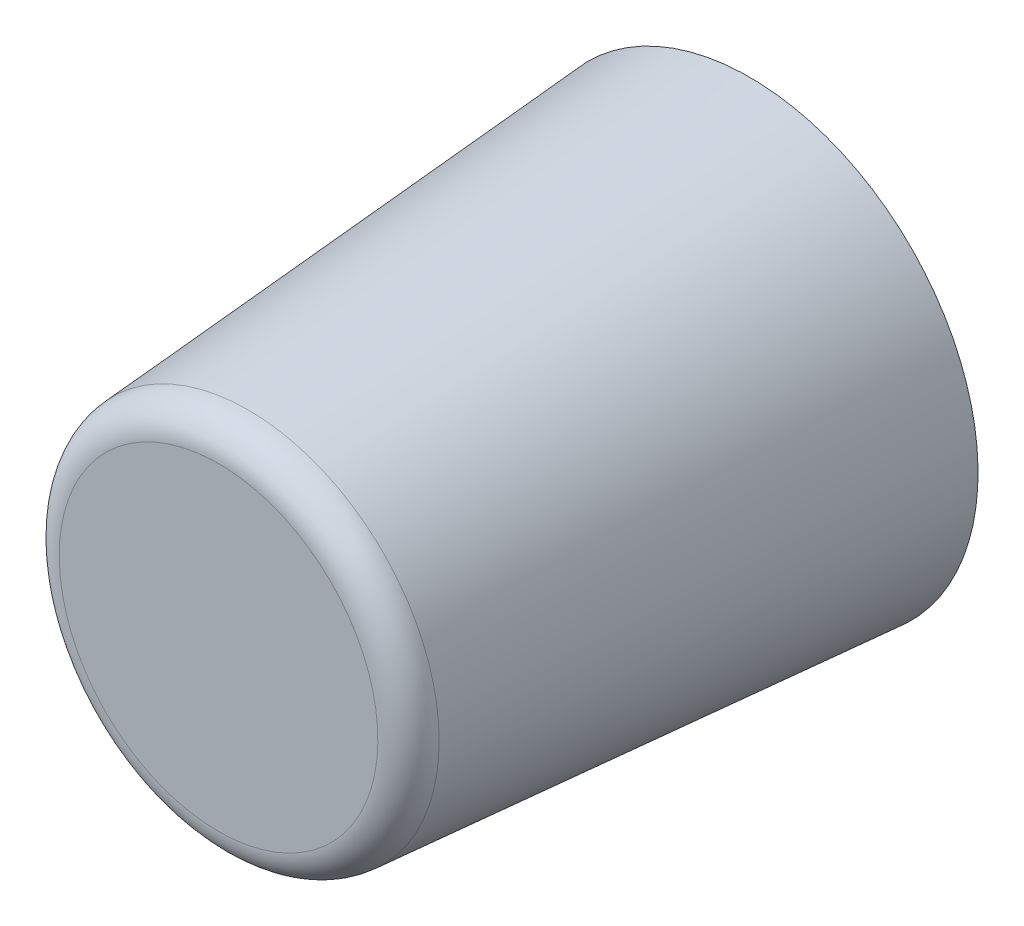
ISO-10303-21;
HEADER;
FILE_DESCRIPTION(('STEP AP214'),'2;1');
FILE_NAME('part.step','',(''),(''),'','','');
FILE_SCHEMA(('AUTOMOTIVE_DESIGN { 1 0 10303 214 1 1 1 1 }'));
ENDSEC;
DATA;
#1=APPLICATION_CONTEXT('core data for automotive mechanical design processes');
#2=APPLICATION_PROTOCOL_DEFINITION('international standard','automotive_design',2000,#1);
#3=PRODUCT_CONTEXT('',#1,'mechanical');
#4=PRODUCT('Part','Part','',(#3));
#5=PRODUCT_RELATED_PRODUCT_CATEGORY('part','',(#4));
#6=PRODUCT_DEFINITION_FORMATION('','',#4);
#7=PRODUCT_DEFINITION_CONTEXT('part definition',#1,'design');
#8=PRODUCT_DEFINITION('design','',#6,#7);
#9=PRODUCT_DEFINITION_SHAPE('','',#8);
#10=(LENGTH_UNIT() NAMED_UNIT(*) SI_UNIT(.MILLI.,.METRE.));
#11=(NAMED_UNIT(*) PLANE_ANGLE_UNIT() SI_UNIT($,.RADIAN.));
#12=(NAMED_UNIT(*) SI_UNIT($,.STERADIAN.) SOLID_ANGLE_UNIT());
#13=UNCERTAINTY_MEASURE_WITH_UNIT(LENGTH_MEASURE(1.E-05),#10,'distance_accuracy_value','');
#14=(GEOMETRIC_REPRESENTATION_CONTEXT(3) GLOBAL_UNCERTAINTY_ASSIGNED_CONTEXT((#13)) GLOBAL_UNIT_ASSIGNED_CONTEXT((#10,
#11,#12)) REPRESENTATION_CONTEXT('',''));
#15=CARTESIAN_POINT('',(0.,0.,0.));
#16=DIRECTION('',(0.,0.,1.));
#17=DIRECTION('',(1.,0.,0.));
#18=AXIS2_PLACEMENT_3D('',#15,#16,#17);
#19=CARTESIAN_POINT('',(0.,0.,50.));
#20=DIRECTION('',(0.,0.,1.));
#21=DIRECTION('',(0.,-1.,0.));
#22=AXIS2_PLACEMENT_3D('',#19,#20,#21);
#23=CYLINDRICAL_SURFACE('',#22,19.35);
#24=CARTESIAN_POINT('',(0.,0.,0.));
#25=DIRECTION('',(0.,0.,1.));
#26=DIRECTION('',(0.,-1.,0.));
#27=AXIS2_PLACEMENT_3D('',#24,#25,#26);
#28=CIRCLE('',#27,19.35);
#29=CARTESIAN_POINT('',(0.,-19.35,0.));
#30=VERTEX_POINT('',#29);
#31=EDGE_CURVE('E8',#30,#30,#28,.T.);
#32=ORIENTED_EDGE('',*,*,#31,.F.);
#33=EDGE_LOOP('',(#32));
#34=FACE_BOUND('',#33,.T.);
#35=CARTESIAN_POINT('',(0.,0.,0.0500000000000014));
#36=DIRECTION('',(0.,0.,1.));
#37=DIRECTION('',(0.,-1.,0.));
#38=AXIS2_PLACEMENT_3D('',#35,#36,#37);
#39=CIRCLE('',#38,19.35);
#40=CARTESIAN_POINT('',(0.,-19.35,0.0500000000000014));
#41=VERTEX_POINT('',#40);
#42=EDGE_CURVE('E34',#41,#41,#39,.T.);
#43=ORIENTED_EDGE('',*,*,#42,.T.);
#44=EDGE_LOOP('',(#43));
#45=FACE_BOUND('',#44,.T.);
#46=ADVANCED_FACE('F12',(#34,#45),#23,.F.);
#47=CARTESIAN_POINT('',(19.35,0.,0.));
#48=DIRECTION('',(0.,0.,1.));
#49=DIRECTION('',(0.,-1.,0.));
#50=AXIS2_PLACEMENT_3D('',#47,#48,#49);
#51=PLANE('',#50);
#52=CARTESIAN_POINT('',(0.,0.,0.));
#53=DIRECTION('',(0.,0.,1.));
#54=DIRECTION('',(0.,-1.,0.));
#55=AXIS2_PLACEMENT_3D('',#52,#53,#54);
#56=CIRCLE('',#55,21.5);
#57=CARTESIAN_POINT('',(0.,-21.5,0.));
#58=VERTEX_POINT('',#57);
#59=EDGE_CURVE('E18',#58,#58,#56,.T.);
#60=ORIENTED_EDGE('',*,*,#59,.F.);
#61=EDGE_LOOP('',(#60));
#62=FACE_BOUND('',#61,.T.);
#63=ORIENTED_EDGE('',*,*,#31,.T.);
#64=EDGE_LOOP('',(#63));
#65=FACE_BOUND('',#64,.T.);
#66=ADVANCED_FACE('F70',(#62,#65),#51,.F.);
#67=CARTESIAN_POINT('',(0.,0.,0.));
#68=DIRECTION('',(0.,0.,-1.));
#69=DIRECTION('',(0.,1.,0.));
#70=AXIS2_PLACEMENT_3D('',#67,#68,#69);
#71=CONICAL_SURFACE('',#70,21.5,0.0741559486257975);
#72=CARTESIAN_POINT('',(0.,0.,47.2222640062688));
#73=DIRECTION('',(0.,0.,1.));
#74=DIRECTION('',(0.,-1.,0.));
#75=AXIS2_PLACEMENT_3D('',#72,#73,#74);
#76=CIRCLE('',#75,17.9917551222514);
#77=CARTESIAN_POINT('',(0.,-17.9917551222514,47.2222640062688));
#78=VERTEX_POINT('',#77);
#79=EDGE_CURVE('E22',#78,#78,#76,.T.);
#80=ORIENTED_EDGE('',*,*,#79,.F.);
#81=EDGE_LOOP('',(#80));
#82=FACE_BOUND('',#81,.T.);
#83=ORIENTED_EDGE('',*,*,#59,.T.);
#84=EDGE_LOOP('',(#83));
#85=FACE_BOUND('',#84,.T.);
#86=ADVANCED_FACE('F75',(#82,#85),#71,.T.);
#87=CARTESIAN_POINT('',(0.,0.,47.));
#88=DIRECTION('',(0.,0.,1.));
#89=DIRECTION('',(0.,-1.,0.));
#90=AXIS2_PLACEMENT_3D('',#87,#88,#89);
#91=TOROIDAL_SURFACE('',#90,15.,3.);
#92=ORIENTED_EDGE('',*,*,#79,.T.);
#93=EDGE_LOOP('',(#92));
#94=FACE_BOUND('',#93,.T.);
#95=CARTESIAN_POINT('',(0.,0.,50.));
#96=DIRECTION('',(0.,0.,1.));
#97=DIRECTION('',(0.,-1.,0.));
#98=AXIS2_PLACEMENT_3D('',#95,#96,#97);
#99=CIRCLE('',#98,15.);
#100=CARTESIAN_POINT('',(0.,-15.,50.));
#101=VERTEX_POINT('',#100);
#102=EDGE_CURVE('E26',#101,#101,#99,.T.);
#103=ORIENTED_EDGE('',*,*,#102,.F.);
#104=EDGE_LOOP('',(#103));
#105=FACE_BOUND('',#104,.T.);
#106=ADVANCED_FACE('F65',(#94,#105),#91,.T.);
#107=CARTESIAN_POINT('',(15.,0.,50.));
#108=DIRECTION('',(0.,0.,-1.));
#109=DIRECTION('',(0.,1.,0.));
#110=AXIS2_PLACEMENT_3D('',#107,#108,#109);
#111=PLANE('',#110);
#112=ORIENTED_EDGE('',*,*,#102,.T.);
#113=EDGE_LOOP('',(#112));
#114=FACE_BOUND('',#113,.T.);
#115=ADVANCED_FACE('F55',(#114),#111,.F.);
#116=CARTESIAN_POINT('',(0.,0.,0.));
#117=DIRECTION('',(0.,0.,1.));
#118=DIRECTION('',(0.,-1.,0.));
#119=AXIS2_PLACEMENT_3D('',#116,#117,#118);
#120=PLANE('',#119);
#121=CARTESIAN_POINT('',(0.,0.,0.));
#122=DIRECTION('',(0.,0.,1.));
#123=DIRECTION('',(0.,-1.,0.));
#124=AXIS2_PLACEMENT_3D('',#121,#122,#123);
#125=CIRCLE('',#124,19.3);
#126=CARTESIAN_POINT('',(0.,-19.3,0.));
#127=VERTEX_POINT('',#126);
#128=EDGE_CURVE('E31',#127,#127,#125,.T.);
#129=ORIENTED_EDGE('',*,*,#128,.F.);
#130=EDGE_LOOP('',(#129));
#131=FACE_BOUND('',#130,.T.);
#132=CARTESIAN_POINT('',(0.,0.,0.));
#133=DIRECTION('',(0.,0.,-1.));
#134=DIRECTION('',(0.,1.,0.));
#135=AXIS2_PLACEMENT_3D('',#132,#133,#134);
#136=CIRCLE('',#135,5.);
#137=CARTESIAN_POINT('',(0.,5.,0.));
#138=VERTEX_POINT('',#137);
#139=EDGE_CURVE('E38',#138,#138,#136,.T.);
#140=ORIENTED_EDGE('',*,*,#139,.F.);
#141=EDGE_LOOP('',(#140));
#142=FACE_BOUND('',#141,.T.);
#143=ADVANCED_FACE('F53',(#131,#142),#120,.F.);
#144=CARTESIAN_POINT('',(0.,0.,0.));
#145=DIRECTION('',(0.,0.,1.));
#146=DIRECTION('',(0.,-1.,0.));
#147=AXIS2_PLACEMENT_3D('',#144,#145,#146);
#148=CONICAL_SURFACE('',#147,19.3,0.785398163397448);
#149=ORIENTED_EDGE('',*,*,#42,.F.);
#150=EDGE_LOOP('',(#149));
#151=FACE_BOUND('',#150,.T.);
#152=ORIENTED_EDGE('',*,*,#128,.T.);
#153=EDGE_LOOP('',(#152));
#154=FACE_BOUND('',#153,.T.);
#155=ADVANCED_FACE('F49',(#151,#154),#148,.T.);
#156=CARTESIAN_POINT('',(0.,0.,10.));
#157=DIRECTION('',(0.,0.,-1.));
#158=DIRECTION('',(0.,1.,0.));
#159=AXIS2_PLACEMENT_3D('',#156,#157,#158);
#160=CYLINDRICAL_SURFACE('',#159,5.);
#161=CARTESIAN_POINT('',(0.,0.,10.));
#162=DIRECTION('',(0.,0.,-1.));
#163=DIRECTION('',(0.,1.,0.));
#164=AXIS2_PLACEMENT_3D('',#161,#162,#163);
#165=CIRCLE('',#164,5.);
#166=CARTESIAN_POINT('',(0.,5.,10.));
#167=VERTEX_POINT('',#166);
#168=EDGE_CURVE('E37',#167,#167,#165,.T.);
#169=ORIENTED_EDGE('',*,*,#168,.F.);
#170=EDGE_LOOP('',(#169));
#171=FACE_BOUND('',#170,.T.);
#172=ORIENTED_EDGE('',*,*,#139,.T.);
#173=EDGE_LOOP('',(#172));
#174=FACE_BOUND('',#173,.T.);
#175=ADVANCED_FACE('F46',(#171,#174),#160,.F.);
#176=CARTESIAN_POINT('',(0.,0.,10.));
#177=DIRECTION('',(0.,0.,-1.));
#178=DIRECTION('',(0.,1.,0.));
#179=AXIS2_PLACEMENT_3D('',#176,#177,#178);
#180=PLANE('',#179);
#181=ORIENTED_EDGE('',*,*,#168,.T.);
#182=EDGE_LOOP('',(#181));
#183=FACE_BOUND('',#182,.T.);
#184=ADVANCED_FACE('F44',(#183),#180,.T.);
#185=CLOSED_SHELL('',(#46,#66,#86,#106,#115,#143,#155,#175,#184));
#186=MANIFOLD_SOLID_BREP('B1',#185);
#187=ADVANCED_BREP_SHAPE_REPRESENTATION('',(#18,#186),#14);
#188=SHAPE_DEFINITION_REPRESENTATION(#9,#187);
ENDSEC;
END-ISO-10303-21;
